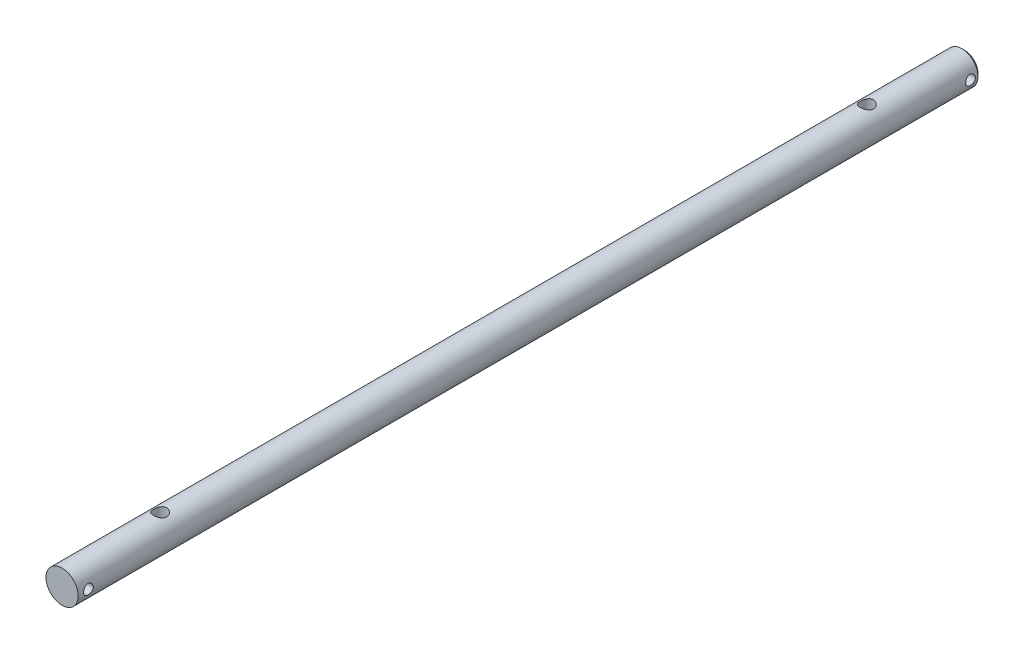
from build123d import *

# Parameters (mm, degrees)
SKETCH1_R                        = 7.9375
ROD_DEPTH                        = 444.5
SPRONG_RETAINER_HOLES_DEPTH      = 445.64171848
SPRONG_RETAINER_HOLES_DEPTH_BACK = 445.64171848
SKETCH2_R                        = 2.38125
DOOR_HOLES_DEPTH                 = 445.641718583
DOOR_HOLES_DEPTH_BACK            = 445.641718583
SKETCH3_R                        = 3.2639


with BuildPart() as part:
    # Sketch1 → rod (new body)
    with BuildSketch(Plane.XY):
        Circle(SKETCH1_R)
    extrude(amount=ROD_DEPTH)

    # Sketch2 → sprong retainer holes (cut, two sides: drawn at the far end of the back side and taken through both)
    with BuildSketch(Plane(origin=(0, 0, 0), x_dir=(0, 0, -1), z_dir=(1, 0, 0)).offset(-SPRONG_RETAINER_HOLES_DEPTH_BACK)):
        with Locations((-5.08, 0.150520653)):
            Circle(SKETCH2_R)
        with Locations((-439.42, 0.150520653)):
            Circle(SKETCH2_R)
    extrude(amount=SPRONG_RETAINER_HOLES_DEPTH + SPRONG_RETAINER_HOLES_DEPTH_BACK, mode=Mode.SUBTRACT)

    # Sketch3 → door holes (cut, two sides: drawn at the far end of the back side and taken through both)
    with BuildSketch(Plane(origin=(0, 0, 0), x_dir=(1, 0, 0), z_dir=(0, 1, 0)).offset(-DOOR_HOLES_DEPTH_BACK)):
        with Locations(Location((0, -48.26, 0), (0, 0, 270))):
            Circle(SKETCH3_R)
        with Locations(Location((0, -396.24, 0), (0, 0, 270))):
            Circle(SKETCH3_R)
    extrude(amount=DOOR_HOLES_DEPTH + DOOR_HOLES_DEPTH_BACK, mode=Mode.SUBTRACT)

    # Sketch4 → Cut-Revolve1 (revolve, cut)
    with BuildSketch(Plane(origin=(0, 0, 0), x_dir=(1, 0, 0), z_dir=(0, 1, 0))):
        Polygon((5.085315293, 1.433940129), (8.804345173, -2.285089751), (8.804345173, -454.850699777), (5.085315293, -458.569729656), (8.804345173, -458.569729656), (13.633955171, -458.569729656), (13.633955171, 1.433940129), (12.303309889, 1.433940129), (8.804345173, 1.433940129), align=None)
    revolve(axis=Axis((0, 0, 0), (0, 0, -1)), mode=Mode.SUBTRACT)


solid = part.part
